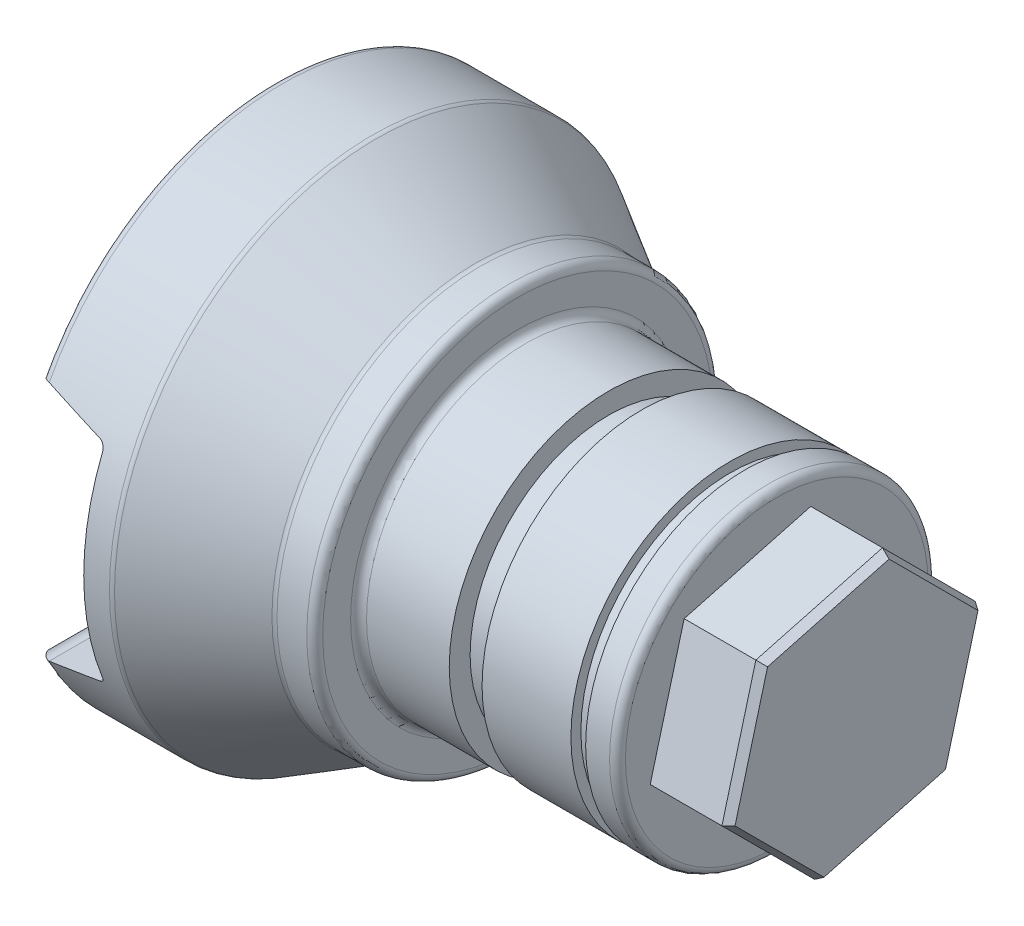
from build123d import *
from OCP.BRepFilletAPI import BRepFilletAPI_MakeChamfer

# Parameters (mm, degrees)
ENL_V_MAT_EXTRU_1_DEPTH = 102.710373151
BOSS_EXTRU_1_DEPTH      = 10
CHANFREIN1_SIZE         = 1
CHANFREIN1_SIZE2        = 0.577350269


with BuildPart() as part:
    # Esquisse2 → Base-R_volution (revolve)
    with BuildSketch(Plane.XY, mode=Mode.PRIVATE) as base_r_volution_sk:
        with BuildLine():
            Line((-69, 33), (-57.767949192, 33))
            ThreePointArc((-57.767949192, 33), (-57.509130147, 32.965925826), (-57.267949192, 32.866025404))
            Line((-57.267949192, 32.866025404), (-44.741669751, 25.633974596))
            ThreePointArc((-44.741669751, 25.633974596), (-44.500488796, 25.534074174), (-44.241669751, 25.5))
            Line((-44.241669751, 25.5), (-40.5, 25.5))
            ThreePointArc((-40.5, 25.5), (-39.792893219, 25.207106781), (-39.5, 24.5))
            Line((-39.5, 24.5), (-39.5, 21))
            ThreePointArc((-39.5, 21), (-39.207106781, 20.292893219), (-38.5, 20))
            Line((-38.5, 20), (-28.12, 20))
            Line((-28.12, 20), (-28.12, 17.38))
            Line((-28.12, 17.38), (-24, 17.38))
            Line((-24, 17.38), (-24, 20))
            Line((-24, 20), (-12.85, 20))
            Line((-12.85, 20), (-12.85, 18.75))
            Line((-12.85, 18.75), (-11, 18.75))
            Line((-11, 18.75), (-11, 20))
            Line((-11, 20), (-8, 20))
            ThreePointArc((-8, 20), (-7.292893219, 19.707106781), (-7, 19))
            Line((-7, 19), (-7, 0))
            Line((-7, 0), (-16, 0))
            Line((-16, 0), (-16, 4.663910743))
            ThreePointArc((-16, 4.663910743), (-16.701866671, 6.592273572), (-18.479055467, 7.618334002))
            Line((-18.479055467, 7.618334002), (-44.868240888, 12.271459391))
            ThreePointArc((-44.868240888, 12.271459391), (-47.566942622, 13.691654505), (-48.938749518, 16.415271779))
            ThreePointArc((-48.938749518, 16.415271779), (-49.756310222, 18.466264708), (-51.377499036, 19.96517242))
            Line((-51.377499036, 19.96517242), (-57.267949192, 23.366025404))
            ThreePointArc((-57.267949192, 23.366025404), (-57.509130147, 23.465925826), (-57.767949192, 23.5))
            Line((-57.767949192, 23.5), (-70, 23.5))
            Line((-70, 23.5), (-70, 32))
            ThreePointArc((-70, 32), (-69.707106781, 32.707106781), (-69, 33))
        make_face()
    revolve(base_r_volution_sk.sketch.rotate(Axis((40, 0, 0), (1, 0, 0)), 90), axis=Axis((40, 0, 0), (1, 0, 0)))

    # Esquisse3 → Enl_v. mat.-Extru.1 (cut, through all)
    with BuildSketch(Plane.XY.offset(33)):
        with BuildLine():
            Line((-61, 12.232673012), (-61, -12.232673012))
            ThreePointArc((-61, -12.232673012), (-61.20664666, -12.841434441), (-61.741180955, -13.198598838))
            Line((-61.741180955, -13.198598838), (-69.009579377, -15.146160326))
            ThreePointArc((-69.009579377, -15.146160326), (-69.877159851, -14.97358784), (-70.268398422, -14.180234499))
            Line((-70.268398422, -14.180234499), (-70.268398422, 14.180234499))
            ThreePointArc((-70.268398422, 14.180234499), (-69.877159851, 14.97358784), (-69.009579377, 15.146160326))
            Line((-69.009579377, 15.146160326), (-61.741180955, 13.198598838))
            ThreePointArc((-61.741180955, 13.198598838), (-61.20664666, 12.841434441), (-61, 12.232673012))
        make_face()
    extrude(amount=-ENL_V_MAT_EXTRU_1_DEPTH, mode=Mode.SUBTRACT)

    # Esquisse4 → Boss.-Extru.1 (add)
    with BuildSketch(Plane(origin=(-7, 0, 0), x_dir=(0, 0, -1), z_dir=(1, 0, 0))):
        Polygon((11.635076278, -11.635076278), (15.893809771, 4.258733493), (4.258733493, 15.893809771), (-11.635076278, 11.635076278), (-15.893809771, -4.258733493), (-4.258733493, -15.893809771), align=None)
    extrude(amount=BOSS_EXTRU_1_DEPTH)

    # Chanfrein1: one chamfer whose edges measure the first distance from different faces: ONE call of the kernel's chamfer builder (chamfer() names one face for all edges)
    chanfrein1_edges_1 = [part.edges().sort_by_distance(p)[0] for p in [
        (3, -13.764443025, -3.688171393),
    ]]
    chanfrein1_side_1 = [part.faces().sort_by_distance(p)[0] for p in [
        (-2, -13.764443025, -3.688171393),
    ]]
    chanfrein1_edges_2 = [part.edges().sort_by_distance(p)[0] for p in [
        (3, -3.688171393, -13.764443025),
    ]]
    chanfrein1_side_2 = [part.faces().sort_by_distance(p)[0] for p in [
        (-2, -3.688171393, -13.764443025),
    ]]
    chanfrein1_edges_3 = [part.edges().sort_by_distance(p)[0] for p in [
        (3, 10.076271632, -10.076271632),
    ]]
    chanfrein1_side_3 = [part.faces().sort_by_distance(p)[0] for p in [
        (-2, 10.076271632, -10.076271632),
    ]]
    chanfrein1_edges_4 = [part.edges().sort_by_distance(p)[0] for p in [
        (3, 13.764443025, 3.688171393),
    ]]
    chanfrein1_side_4 = [part.faces().sort_by_distance(p)[0] for p in [
        (-2, 13.764443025, 3.688171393),
    ]]
    chanfrein1_edges_5 = [part.edges().sort_by_distance(p)[0] for p in [
        (3, 3.688171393, 13.764443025),
    ]]
    chanfrein1_side_5 = [part.faces().sort_by_distance(p)[0] for p in [
        (-2, 3.688171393, 13.764443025),
    ]]
    chanfrein1_edges_6 = [part.edges().sort_by_distance(p)[0] for p in [
        (3, -10.076271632, 10.076271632),
    ]]
    chanfrein1_side_6 = [part.faces().sort_by_distance(p)[0] for p in [
        (-2, -10.076271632, 10.076271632),
    ]]
    chanfrein1 = BRepFilletAPI_MakeChamfer(part.part.solid().wrapped)
    for e in chanfrein1_edges_1:
        chanfrein1.Add(CHANFREIN1_SIZE, CHANFREIN1_SIZE2, e.wrapped, chanfrein1_side_1[0].wrapped)  # the first distance lies on this face
    for e in chanfrein1_edges_2:
        chanfrein1.Add(CHANFREIN1_SIZE, CHANFREIN1_SIZE2, e.wrapped, chanfrein1_side_2[0].wrapped)  # the first distance lies on this face
    for e in chanfrein1_edges_3:
        chanfrein1.Add(CHANFREIN1_SIZE, CHANFREIN1_SIZE2, e.wrapped, chanfrein1_side_3[0].wrapped)  # the first distance lies on this face
    for e in chanfrein1_edges_4:
        chanfrein1.Add(CHANFREIN1_SIZE, CHANFREIN1_SIZE2, e.wrapped, chanfrein1_side_4[0].wrapped)  # the first distance lies on this face
    for e in chanfrein1_edges_5:
        chanfrein1.Add(CHANFREIN1_SIZE, CHANFREIN1_SIZE2, e.wrapped, chanfrein1_side_5[0].wrapped)  # the first distance lies on this face
    for e in chanfrein1_edges_6:
        chanfrein1.Add(CHANFREIN1_SIZE, CHANFREIN1_SIZE2, e.wrapped, chanfrein1_side_6[0].wrapped)  # the first distance lies on this face
    add(Compound.cast(chanfrein1.Shape()), mode=Mode.REPLACE)


solid = part.part
